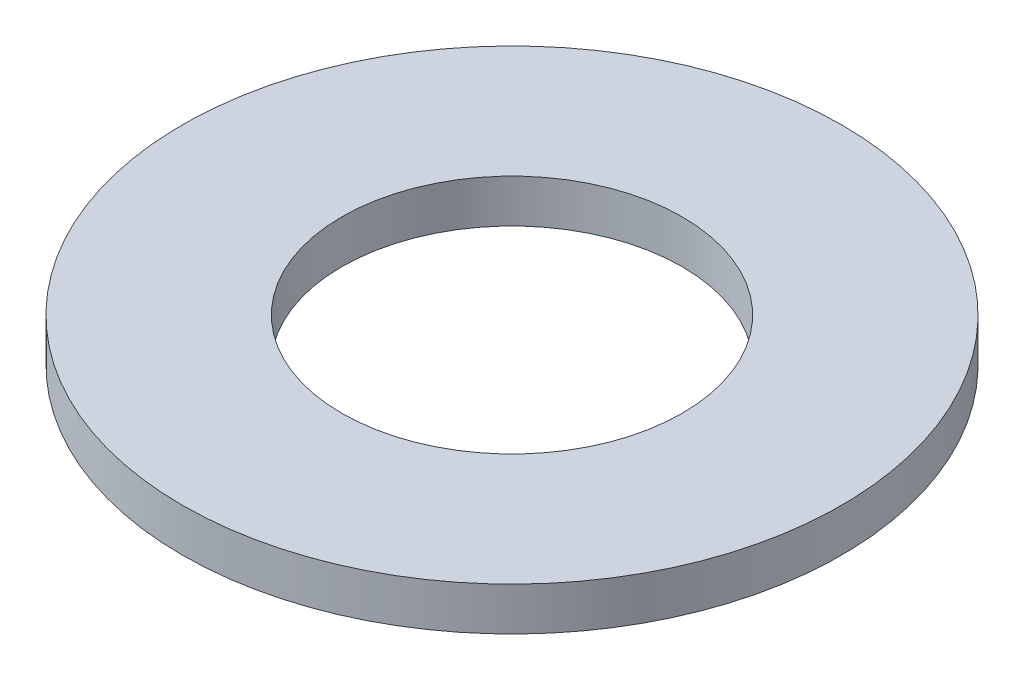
ISO-10303-21;
HEADER;
FILE_DESCRIPTION(('STEP AP214'),'2;1');
FILE_NAME('part.step','',(''),(''),'','','');
FILE_SCHEMA(('AUTOMOTIVE_DESIGN { 1 0 10303 214 1 1 1 1 }'));
ENDSEC;
DATA;
#1=APPLICATION_CONTEXT('core data for automotive mechanical design processes');
#2=APPLICATION_PROTOCOL_DEFINITION('international standard','automotive_design',2000,#1);
#3=PRODUCT_CONTEXT('',#1,'mechanical');
#4=PRODUCT('Part','Part','',(#3));
#5=PRODUCT_RELATED_PRODUCT_CATEGORY('part','',(#4));
#6=PRODUCT_DEFINITION_FORMATION('','',#4);
#7=PRODUCT_DEFINITION_CONTEXT('part definition',#1,'design');
#8=PRODUCT_DEFINITION('design','',#6,#7);
#9=PRODUCT_DEFINITION_SHAPE('','',#8);
#10=(LENGTH_UNIT() NAMED_UNIT(*) SI_UNIT(.MILLI.,.METRE.));
#11=(NAMED_UNIT(*) PLANE_ANGLE_UNIT() SI_UNIT($,.RADIAN.));
#12=(NAMED_UNIT(*) SI_UNIT($,.STERADIAN.) SOLID_ANGLE_UNIT());
#13=UNCERTAINTY_MEASURE_WITH_UNIT(LENGTH_MEASURE(1.E-05),#10,'distance_accuracy_value','');
#14=(GEOMETRIC_REPRESENTATION_CONTEXT(3) GLOBAL_UNCERTAINTY_ASSIGNED_CONTEXT((#13)) GLOBAL_UNIT_ASSIGNED_CONTEXT((#10,
#11,#12)) REPRESENTATION_CONTEXT('',''));
#15=CARTESIAN_POINT('',(0.,0.,0.));
#16=DIRECTION('',(0.,0.,1.));
#17=DIRECTION('',(1.,0.,0.));
#18=AXIS2_PLACEMENT_3D('',#15,#16,#17);
#19=CARTESIAN_POINT('',(0.,-3.83114593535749,0.));
#20=DIRECTION('',(0.,-1.,0.));
#21=DIRECTION('',(0.,0.,-1.));
#22=AXIS2_PLACEMENT_3D('',#19,#20,#21);
#23=CYLINDRICAL_SURFACE('',#22,61.);
#24=CARTESIAN_POINT('',(0.,0.,0.));
#25=DIRECTION('',(0.,-1.,0.));
#26=DIRECTION('',(0.,0.,-1.));
#27=AXIS2_PLACEMENT_3D('',#24,#25,#26);
#28=CIRCLE('',#27,61.);
#29=CARTESIAN_POINT('',(0.,0.,-61.));
#30=VERTEX_POINT('',#29);
#31=EDGE_CURVE('E10',#30,#30,#28,.T.);
#32=ORIENTED_EDGE('',*,*,#31,.F.);
#33=EDGE_LOOP('',(#32));
#34=FACE_BOUND('',#33,.T.);
#35=CARTESIAN_POINT('',(0.,8.,0.));
#36=DIRECTION('',(0.,-1.,0.));
#37=DIRECTION('',(0.,0.,-1.));
#38=AXIS2_PLACEMENT_3D('',#35,#36,#37);
#39=CIRCLE('',#38,61.);
#40=CARTESIAN_POINT('',(0.,8.,-61.));
#41=VERTEX_POINT('',#40);
#42=EDGE_CURVE('E44',#41,#41,#39,.T.);
#43=ORIENTED_EDGE('',*,*,#42,.T.);
#44=EDGE_LOOP('',(#43));
#45=FACE_BOUND('',#44,.T.);
#46=ADVANCED_FACE('F30',(#34,#45),#23,.T.);
#47=CARTESIAN_POINT('',(-61.,0.,0.));
#48=DIRECTION('',(0.,1.,0.));
#49=DIRECTION('',(0.,0.,1.));
#50=AXIS2_PLACEMENT_3D('',#47,#48,#49);
#51=PLANE('',#50);
#52=CARTESIAN_POINT('',(0.,0.,0.));
#53=DIRECTION('',(0.,-1.,0.));
#54=DIRECTION('',(0.,0.,-1.));
#55=AXIS2_PLACEMENT_3D('',#52,#53,#54);
#56=CIRCLE('',#55,31.5);
#57=CARTESIAN_POINT('',(0.,0.,-31.5));
#58=VERTEX_POINT('',#57);
#59=EDGE_CURVE('E36',#58,#58,#56,.T.);
#60=ORIENTED_EDGE('',*,*,#59,.F.);
#61=EDGE_LOOP('',(#60));
#62=FACE_BOUND('',#61,.T.);
#63=ORIENTED_EDGE('',*,*,#31,.T.);
#64=EDGE_LOOP('',(#63));
#65=FACE_BOUND('',#64,.T.);
#66=ADVANCED_FACE('F59',(#62,#65),#51,.F.);
#67=CARTESIAN_POINT('',(0.,-3.83114593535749,0.));
#68=DIRECTION('',(0.,-1.,0.));
#69=DIRECTION('',(0.,0.,-1.));
#70=AXIS2_PLACEMENT_3D('',#67,#68,#69);
#71=CYLINDRICAL_SURFACE('',#70,31.5);
#72=CARTESIAN_POINT('',(0.,8.,0.));
#73=DIRECTION('',(0.,-1.,0.));
#74=DIRECTION('',(0.,0.,-1.));
#75=AXIS2_PLACEMENT_3D('',#72,#73,#74);
#76=CIRCLE('',#75,31.5);
#77=CARTESIAN_POINT('',(0.,8.,-31.5));
#78=VERTEX_POINT('',#77);
#79=EDGE_CURVE('E40',#78,#78,#76,.T.);
#80=ORIENTED_EDGE('',*,*,#79,.F.);
#81=EDGE_LOOP('',(#80));
#82=FACE_BOUND('',#81,.T.);
#83=ORIENTED_EDGE('',*,*,#59,.T.);
#84=EDGE_LOOP('',(#83));
#85=FACE_BOUND('',#84,.T.);
#86=ADVANCED_FACE('F54',(#82,#85),#71,.F.);
#87=CARTESIAN_POINT('',(-61.,8.,0.));
#88=DIRECTION('',(0.,-1.,0.));
#89=DIRECTION('',(0.,0.,-1.));
#90=AXIS2_PLACEMENT_3D('',#87,#88,#89);
#91=PLANE('',#90);
#92=ORIENTED_EDGE('',*,*,#42,.F.);
#93=EDGE_LOOP('',(#92));
#94=FACE_BOUND('',#93,.T.);
#95=ORIENTED_EDGE('',*,*,#79,.T.);
#96=EDGE_LOOP('',(#95));
#97=FACE_BOUND('',#96,.T.);
#98=ADVANCED_FACE('F51',(#94,#97),#91,.F.);
#99=CLOSED_SHELL('',(#46,#66,#86,#98));
#100=MANIFOLD_SOLID_BREP('B2',#99);
#101=ADVANCED_BREP_SHAPE_REPRESENTATION('',(#18,#100),#14);
#102=SHAPE_DEFINITION_REPRESENTATION(#9,#101);
ENDSEC;
END-ISO-10303-21;
